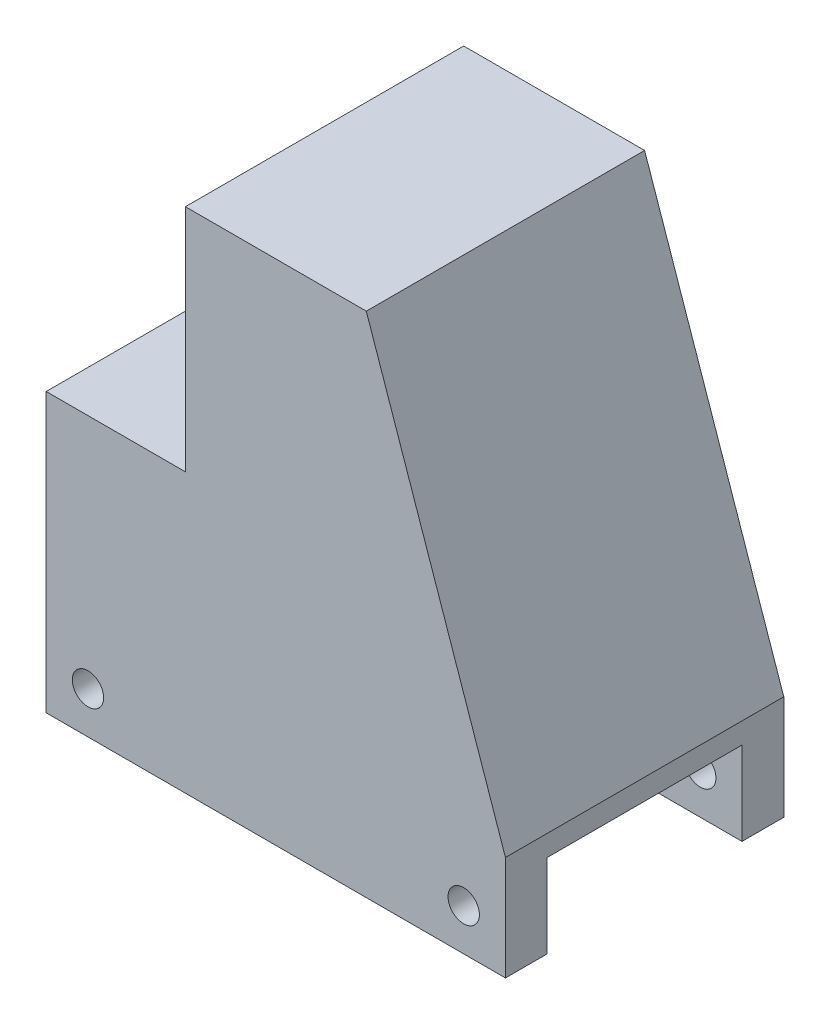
from build123d import *

# Parameters (mm, degrees)
EXTRUDE_1_DEPTH             = 40
HOLE_WIZARD_21_0_21_1_D     = 21.2
HOLE_WIZARD_21_0_21_1_DEPTH = 21
HOLE_WIZARD_21_0_21_1_TIP   = 6.369122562
HOLE_WIZARD_M41_D           = 3.3
HOLE_WIZARD_M41_DEPTH       = 13
HOLE_WIZARD_M41_TIP         = 0.991420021
CHAMFER_1_SIZE              = 0.5
SKETCH_6_W                  = 28
SKETCH_6_H                  = 12
CUT_EXTRUDE_1_DEPTH         = 107.230880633
SKETCH_7_R                  = 2.25
CUT_EXTRUDE_2_DEPTH         = 107.230880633
CUT_EXTRUDE_3_REACH         = 100.372
CUT_EXTRUDE_3_END_RADIUS    = 10.6
SKETCH_8_R                  = 8


with BuildPart() as part:
    # Sketch 1 → Extrude 1 (new body)
    with BuildSketch(Plane.XY):
        Polygon((-66, 0), (0, 0), (0, 15), (-20, 73), (-46, 73), (-46, 40), (-66, 40), align=None)
    extrude(amount=-EXTRUDE_1_DEPTH)

    # Hole Wizard 21.0 _21_1
    with Locations(Plane.ZY.offset(46)):
        with Locations((-20, 59)):
            Hole(HOLE_WIZARD_21_0_21_1_D / 2, depth=HOLE_WIZARD_21_0_21_1_DEPTH)
            with Locations((0, 0, -(HOLE_WIZARD_21_0_21_1_DEPTH + HOLE_WIZARD_21_0_21_1_TIP / 2))):  # 118° drill point
                Cone(0, HOLE_WIZARD_21_0_21_1_D / 2, HOLE_WIZARD_21_0_21_1_TIP, mode=Mode.SUBTRACT)

    # Hole Wizard M41
    with Locations(Plane(origin=(0, 40, 0), x_dir=(1, 0, 0), z_dir=(0, 1, 0))):
        with Locations((-56, 20)):
            Hole(HOLE_WIZARD_M41_D / 2, depth=HOLE_WIZARD_M41_DEPTH)
            with Locations((0, 0, -(HOLE_WIZARD_M41_DEPTH + HOLE_WIZARD_M41_TIP / 2))):  # 118° drill point
                Cone(0, HOLE_WIZARD_M41_D / 2, HOLE_WIZARD_M41_TIP, mode=Mode.SUBTRACT)

    # Chamfer 1
    chamfer_1_edges = [part.edges().sort_by_distance(p)[0] for p in [
        (-54.35, 40, -20),
    ]]
    chamfer(chamfer_1_edges, length=CHAMFER_1_SIZE)

    # Sketch 6 → Cut-Extrude 1 (cut, through all)
    with BuildSketch(Plane.ZY.offset(66)):
        with Locations((-20, 6)):
            Rectangle(SKETCH_6_W, SKETCH_6_H)
    extrude(amount=-CUT_EXTRUDE_1_DEPTH, mode=Mode.SUBTRACT)

    # Sketch 7 → Cut-Extrude 2 (cut, through all)
    with BuildSketch(Plane.XY):
        with Locations((-6, 6)):
            Circle(SKETCH_7_R)
        with Locations((-60, 6)):
            Circle(SKETCH_7_R)
    extrude(amount=-CUT_EXTRUDE_2_DEPTH, mode=Mode.SUBTRACT)

    # Cut-Extrude 3: up to this cylinder (the profile starts outside it)
    cut_extrude_3_end = Plane(origin=(-33, 59, -20), z_dir=(-1, 0, 0)) * Cylinder(CUT_EXTRUDE_3_END_RADIUS, 222.944, mode=Mode.PRIVATE)
    # Sketch 8 → Cut-Extrude 3 (cut, up to the surface)
    with BuildSketch(Plane.XZ.offset(-12), mode=Mode.PRIVATE) as cut_extrude_3_sk1:
        with Locations(Location((-33, -20, 0), (0, 0, 270))):
            Circle(SKETCH_8_R)
    cut_extrude_3_tool1 = extrude(cut_extrude_3_sk1.sketch, amount=-CUT_EXTRUDE_3_REACH, mode=Mode.PRIVATE) - cut_extrude_3_end
    add(cut_extrude_3_tool1.solids().sort_by_distance((-33, 12, -20))[0], mode=Mode.SUBTRACT)


solid = part.part
